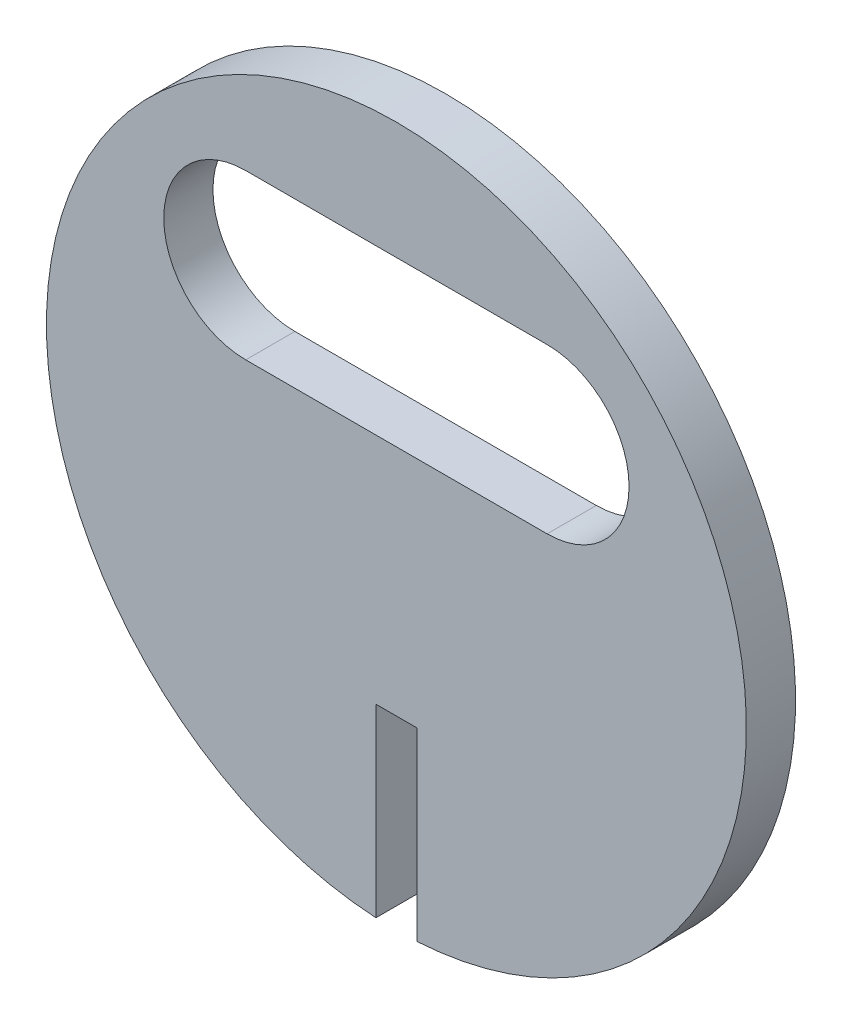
ISO-10303-21;
HEADER;
FILE_DESCRIPTION(('STEP AP214'),'2;1');
FILE_NAME('part.step','',(''),(''),'','','');
FILE_SCHEMA(('AUTOMOTIVE_DESIGN { 1 0 10303 214 1 1 1 1 }'));
ENDSEC;
DATA;
#1=APPLICATION_CONTEXT('core data for automotive mechanical design processes');
#2=APPLICATION_PROTOCOL_DEFINITION('international standard','automotive_design',2000,#1);
#3=PRODUCT_CONTEXT('',#1,'mechanical');
#4=PRODUCT('Part','Part','',(#3));
#5=PRODUCT_RELATED_PRODUCT_CATEGORY('part','',(#4));
#6=PRODUCT_DEFINITION_FORMATION('','',#4);
#7=PRODUCT_DEFINITION_CONTEXT('part definition',#1,'design');
#8=PRODUCT_DEFINITION('design','',#6,#7);
#9=PRODUCT_DEFINITION_SHAPE('','',#8);
#10=(LENGTH_UNIT() NAMED_UNIT(*) SI_UNIT(.MILLI.,.METRE.));
#11=(NAMED_UNIT(*) PLANE_ANGLE_UNIT() SI_UNIT($,.RADIAN.));
#12=(NAMED_UNIT(*) SI_UNIT($,.STERADIAN.) SOLID_ANGLE_UNIT());
#13=UNCERTAINTY_MEASURE_WITH_UNIT(LENGTH_MEASURE(1.E-05),#10,'distance_accuracy_value','');
#14=(GEOMETRIC_REPRESENTATION_CONTEXT(3) GLOBAL_UNCERTAINTY_ASSIGNED_CONTEXT((#13)) GLOBAL_UNIT_ASSIGNED_CONTEXT((#10,
#11,#12)) REPRESENTATION_CONTEXT('',''));
#15=CARTESIAN_POINT('',(0.,0.,0.));
#16=DIRECTION('',(0.,0.,1.));
#17=DIRECTION('',(1.,0.,0.));
#18=AXIS2_PLACEMENT_3D('',#15,#16,#17);
#19=CARTESIAN_POINT('',(0.,0.,3.81));
#20=DIRECTION('',(0.,0.,1.));
#21=DIRECTION('',(1.,0.,0.));
#22=AXIS2_PLACEMENT_3D('',#19,#20,#21);
#23=PLANE('',#22);
#24=CARTESIAN_POINT('',(11.6743329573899,11.6743329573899,3.81));
#25=DIRECTION('',(0.,0.,1.));
#26=DIRECTION('',(1.,0.,0.));
#27=AXIS2_PLACEMENT_3D('',#24,#25,#26);
#28=CIRCLE('',#27,6.35);
#29=CARTESIAN_POINT('',(11.6743329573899,5.32433295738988,3.81));
#30=VERTEX_POINT('',#29);
#31=CARTESIAN_POINT('',(11.6743329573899,18.0243329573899,3.81));
#32=VERTEX_POINT('',#31);
#33=EDGE_CURVE('E142',#30,#32,#28,.T.);
#34=ORIENTED_EDGE('',*,*,#33,.F.);
#35=DIRECTION('',(1.,0.,0.));
#36=VECTOR('',#35,1.);
#37=CARTESIAN_POINT('',(11.6743329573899,5.32433295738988,3.81));
#38=LINE('',#37,#36);
#39=CARTESIAN_POINT('',(-11.6743329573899,5.32433295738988,3.81));
#40=VERTEX_POINT('',#39);
#41=EDGE_CURVE('E140',#40,#30,#38,.T.);
#42=ORIENTED_EDGE('',*,*,#41,.F.);
#43=CARTESIAN_POINT('',(-11.6743329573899,11.6743329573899,3.81));
#44=DIRECTION('',(0.,0.,1.));
#45=DIRECTION('',(-1.,0.,0.));
#46=AXIS2_PLACEMENT_3D('',#43,#44,#45);
#47=CIRCLE('',#46,6.35);
#48=CARTESIAN_POINT('',(-11.6743329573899,18.0243329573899,3.81));
#49=VERTEX_POINT('',#48);
#50=EDGE_CURVE('E138',#49,#40,#47,.T.);
#51=ORIENTED_EDGE('',*,*,#50,.F.);
#52=DIRECTION('',(-1.,0.,0.));
#53=VECTOR('',#52,1.);
#54=CARTESIAN_POINT('',(-11.6743329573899,18.0243329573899,3.81));
#55=LINE('',#54,#53);
#56=EDGE_CURVE('E144',#32,#49,#55,.T.);
#57=ORIENTED_EDGE('',*,*,#56,.F.);
#58=EDGE_LOOP('',(#34,#42,#51,#57));
#59=FACE_BOUND('',#58,.T.);
#60=CARTESIAN_POINT('',(0.,0.,3.81));
#61=DIRECTION('',(0.,0.,1.));
#62=DIRECTION('',(1.,0.,0.));
#63=AXIS2_PLACEMENT_3D('',#60,#61,#62);
#64=CIRCLE('',#63,27.1145);
#65=CARTESIAN_POINT('',(1.5875,-27.0679876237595,3.81));
#66=VERTEX_POINT('',#65);
#67=CARTESIAN_POINT('',(-1.5875,-27.0679876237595,3.81));
#68=VERTEX_POINT('',#67);
#69=EDGE_CURVE('E155',#66,#68,#64,.T.);
#70=ORIENTED_EDGE('',*,*,#69,.T.);
#71=DIRECTION('',(0.,-1.,0.));
#72=VECTOR('',#71,1.);
#73=CARTESIAN_POINT('',(-1.5875,-12.7381,3.81));
#74=LINE('',#73,#72);
#75=CARTESIAN_POINT('',(-1.5875,-12.7381,3.81));
#76=VERTEX_POINT('',#75);
#77=EDGE_CURVE('E112',#76,#68,#74,.T.);
#78=ORIENTED_EDGE('',*,*,#77,.F.);
#79=DIRECTION('',(-1.,0.,0.));
#80=VECTOR('',#79,1.);
#81=CARTESIAN_POINT('',(-1.5875,-12.7381,3.81));
#82=LINE('',#81,#80);
#83=CARTESIAN_POINT('',(1.5875,-12.7381,3.81));
#84=VERTEX_POINT('',#83);
#85=EDGE_CURVE('E124',#84,#76,#82,.T.);
#86=ORIENTED_EDGE('',*,*,#85,.F.);
#87=DIRECTION('',(0.,1.,0.));
#88=VECTOR('',#87,1.);
#89=CARTESIAN_POINT('',(1.5875,-12.7381,3.81));
#90=LINE('',#89,#88);
#91=EDGE_CURVE('E99',#66,#84,#90,.T.);
#92=ORIENTED_EDGE('',*,*,#91,.F.);
#93=EDGE_LOOP('',(#70,#78,#86,#92));
#94=FACE_BOUND('',#93,.T.);
#95=ADVANCED_FACE('F33',(#59,#94),#23,.T.);
#96=CARTESIAN_POINT('',(0.,0.,0.));
#97=DIRECTION('',(0.,0.,1.));
#98=DIRECTION('',(1.,0.,0.));
#99=AXIS2_PLACEMENT_3D('',#96,#97,#98);
#100=PLANE('',#99);
#101=DIRECTION('',(1.,0.,0.));
#102=VECTOR('',#101,1.);
#103=CARTESIAN_POINT('',(11.6743329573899,5.32433295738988,0.));
#104=LINE('',#103,#102);
#105=CARTESIAN_POINT('',(-11.6743329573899,5.32433295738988,0.));
#106=VERTEX_POINT('',#105);
#107=CARTESIAN_POINT('',(11.6743329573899,5.32433295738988,0.));
#108=VERTEX_POINT('',#107);
#109=EDGE_CURVE('E102',#106,#108,#104,.T.);
#110=ORIENTED_EDGE('',*,*,#109,.T.);
#111=CARTESIAN_POINT('',(11.6743329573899,11.6743329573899,0.));
#112=DIRECTION('',(0.,0.,1.));
#113=DIRECTION('',(-1.,0.,0.));
#114=AXIS2_PLACEMENT_3D('',#111,#112,#113);
#115=CIRCLE('',#114,6.35);
#116=CARTESIAN_POINT('',(11.6743329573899,18.0243329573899,0.));
#117=VERTEX_POINT('',#116);
#118=EDGE_CURVE('E129',#108,#117,#115,.T.);
#119=ORIENTED_EDGE('',*,*,#118,.T.);
#120=DIRECTION('',(-1.,0.,0.));
#121=VECTOR('',#120,1.);
#122=CARTESIAN_POINT('',(-11.6743329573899,18.0243329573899,0.));
#123=LINE('',#122,#121);
#124=CARTESIAN_POINT('',(-11.6743329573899,18.0243329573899,0.));
#125=VERTEX_POINT('',#124);
#126=EDGE_CURVE('E132',#117,#125,#123,.T.);
#127=ORIENTED_EDGE('',*,*,#126,.T.);
#128=CARTESIAN_POINT('',(-11.6743329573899,11.6743329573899,0.));
#129=DIRECTION('',(0.,0.,1.));
#130=DIRECTION('',(1.,0.,0.));
#131=AXIS2_PLACEMENT_3D('',#128,#129,#130);
#132=CIRCLE('',#131,6.35);
#133=EDGE_CURVE('E135',#125,#106,#132,.T.);
#134=ORIENTED_EDGE('',*,*,#133,.T.);
#135=EDGE_LOOP('',(#110,#119,#127,#134));
#136=FACE_BOUND('',#135,.T.);
#137=DIRECTION('',(0.,-1.,0.));
#138=VECTOR('',#137,1.);
#139=CARTESIAN_POINT('',(-1.5875,-12.7381,0.));
#140=LINE('',#139,#138);
#141=CARTESIAN_POINT('',(-1.5875,-12.7381,0.));
#142=VERTEX_POINT('',#141);
#143=CARTESIAN_POINT('',(-1.5875,-27.0679876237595,0.));
#144=VERTEX_POINT('',#143);
#145=EDGE_CURVE('E118',#142,#144,#140,.T.);
#146=ORIENTED_EDGE('',*,*,#145,.T.);
#147=CARTESIAN_POINT('',(0.,0.,0.));
#148=DIRECTION('',(0.,0.,1.));
#149=DIRECTION('',(1.,0.,0.));
#150=AXIS2_PLACEMENT_3D('',#147,#148,#149);
#151=CIRCLE('',#150,27.1145);
#152=CARTESIAN_POINT('',(1.5875,-27.0679876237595,0.));
#153=VERTEX_POINT('',#152);
#154=EDGE_CURVE('E117',#153,#144,#151,.T.);
#155=ORIENTED_EDGE('',*,*,#154,.F.);
#156=DIRECTION('',(0.,1.,0.));
#157=VECTOR('',#156,1.);
#158=CARTESIAN_POINT('',(1.5875,-12.7381,0.));
#159=LINE('',#158,#157);
#160=CARTESIAN_POINT('',(1.5875,-12.7381,0.));
#161=VERTEX_POINT('',#160);
#162=EDGE_CURVE('E48',#153,#161,#159,.T.);
#163=ORIENTED_EDGE('',*,*,#162,.T.);
#164=DIRECTION('',(-1.,0.,0.));
#165=VECTOR('',#164,1.);
#166=CARTESIAN_POINT('',(-1.5875,-12.7381,0.));
#167=LINE('',#166,#165);
#168=EDGE_CURVE('E106',#161,#142,#167,.T.);
#169=ORIENTED_EDGE('',*,*,#168,.T.);
#170=EDGE_LOOP('',(#146,#155,#163,#169));
#171=FACE_BOUND('',#170,.T.);
#172=ADVANCED_FACE('F115',(#136,#171),#100,.F.);
#173=CARTESIAN_POINT('',(0.,0.,3.81));
#174=DIRECTION('',(0.,0.,-1.));
#175=DIRECTION('',(-1.,0.,0.));
#176=AXIS2_PLACEMENT_3D('',#173,#174,#175);
#177=CYLINDRICAL_SURFACE('',#176,27.1145);
#178=DIRECTION('',(0.,0.,-1.));
#179=VECTOR('',#178,1.);
#180=CARTESIAN_POINT('',(-1.5875,-27.0679876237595,3.81));
#181=LINE('',#180,#179);
#182=EDGE_CURVE('E11',#68,#144,#181,.T.);
#183=ORIENTED_EDGE('',*,*,#182,.F.);
#184=ORIENTED_EDGE('',*,*,#69,.F.);
#185=DIRECTION('',(0.,0.,-1.));
#186=VECTOR('',#185,1.);
#187=CARTESIAN_POINT('',(1.5875,-27.0679876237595,3.81));
#188=LINE('',#187,#186);
#189=EDGE_CURVE('E41',#153,#66,#188,.F.);
#190=ORIENTED_EDGE('',*,*,#189,.F.);
#191=ORIENTED_EDGE('',*,*,#154,.T.);
#192=EDGE_LOOP('',(#183,#184,#190,#191));
#193=FACE_BOUND('',#192,.T.);
#194=ADVANCED_FACE('F35',(#193),#177,.T.);
#195=CARTESIAN_POINT('',(11.6743329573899,5.32433295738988,3.81));
#196=DIRECTION('',(0.,1.,0.));
#197=DIRECTION('',(0.,0.,1.));
#198=AXIS2_PLACEMENT_3D('',#195,#196,#197);
#199=PLANE('',#198);
#200=ORIENTED_EDGE('',*,*,#109,.F.);
#201=DIRECTION('',(0.,0.,-1.));
#202=VECTOR('',#201,1.);
#203=CARTESIAN_POINT('',(-11.6743329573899,5.32433295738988,3.81));
#204=LINE('',#203,#202);
#205=EDGE_CURVE('E152',#40,#106,#204,.T.);
#206=ORIENTED_EDGE('',*,*,#205,.F.);
#207=ORIENTED_EDGE('',*,*,#41,.T.);
#208=DIRECTION('',(0.,0.,-1.));
#209=VECTOR('',#208,1.);
#210=CARTESIAN_POINT('',(11.6743329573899,5.32433295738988,3.81));
#211=LINE('',#210,#209);
#212=EDGE_CURVE('E149',#30,#108,#211,.T.);
#213=ORIENTED_EDGE('',*,*,#212,.T.);
#214=EDGE_LOOP('',(#200,#206,#207,#213));
#215=FACE_BOUND('',#214,.T.);
#216=ADVANCED_FACE('F183',(#215),#199,.T.);
#217=CARTESIAN_POINT('',(11.6743329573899,11.6743329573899,3.81));
#218=DIRECTION('',(0.,0.,-1.));
#219=DIRECTION('',(-1.,0.,0.));
#220=AXIS2_PLACEMENT_3D('',#217,#218,#219);
#221=CYLINDRICAL_SURFACE('',#220,6.35);
#222=ORIENTED_EDGE('',*,*,#118,.F.);
#223=ORIENTED_EDGE('',*,*,#212,.F.);
#224=ORIENTED_EDGE('',*,*,#33,.T.);
#225=DIRECTION('',(0.,0.,-1.));
#226=VECTOR('',#225,1.);
#227=CARTESIAN_POINT('',(11.6743329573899,18.0243329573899,3.81));
#228=LINE('',#227,#226);
#229=EDGE_CURVE('E147',#32,#117,#228,.T.);
#230=ORIENTED_EDGE('',*,*,#229,.T.);
#231=EDGE_LOOP('',(#222,#223,#224,#230));
#232=FACE_BOUND('',#231,.T.);
#233=ADVANCED_FACE('F186',(#232),#221,.F.);
#234=CARTESIAN_POINT('',(-11.6743329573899,18.0243329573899,3.81));
#235=DIRECTION('',(0.,-1.,0.));
#236=DIRECTION('',(0.,0.,-1.));
#237=AXIS2_PLACEMENT_3D('',#234,#235,#236);
#238=PLANE('',#237);
#239=ORIENTED_EDGE('',*,*,#126,.F.);
#240=ORIENTED_EDGE('',*,*,#229,.F.);
#241=ORIENTED_EDGE('',*,*,#56,.T.);
#242=DIRECTION('',(0.,0.,-1.));
#243=VECTOR('',#242,1.);
#244=CARTESIAN_POINT('',(-11.6743329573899,18.0243329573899,3.81));
#245=LINE('',#244,#243);
#246=EDGE_CURVE('E56',#49,#125,#245,.T.);
#247=ORIENTED_EDGE('',*,*,#246,.T.);
#248=EDGE_LOOP('',(#239,#240,#241,#247));
#249=FACE_BOUND('',#248,.T.);
#250=ADVANCED_FACE('F172',(#249),#238,.T.);
#251=CARTESIAN_POINT('',(-11.6743329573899,11.6743329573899,3.81));
#252=DIRECTION('',(0.,0.,-1.));
#253=DIRECTION('',(-1.,0.,0.));
#254=AXIS2_PLACEMENT_3D('',#251,#252,#253);
#255=CYLINDRICAL_SURFACE('',#254,6.35);
#256=ORIENTED_EDGE('',*,*,#133,.F.);
#257=ORIENTED_EDGE('',*,*,#246,.F.);
#258=ORIENTED_EDGE('',*,*,#50,.T.);
#259=ORIENTED_EDGE('',*,*,#205,.T.);
#260=EDGE_LOOP('',(#256,#257,#258,#259));
#261=FACE_BOUND('',#260,.T.);
#262=ADVANCED_FACE('F165',(#261),#255,.F.);
#263=CARTESIAN_POINT('',(-1.5875,-12.7381,3.81));
#264=DIRECTION('',(1.,0.,0.));
#265=DIRECTION('',(0.,1.,0.));
#266=AXIS2_PLACEMENT_3D('',#263,#264,#265);
#267=PLANE('',#266);
#268=ORIENTED_EDGE('',*,*,#182,.T.);
#269=ORIENTED_EDGE('',*,*,#145,.F.);
#270=DIRECTION('',(0.,0.,-1.));
#271=VECTOR('',#270,1.);
#272=CARTESIAN_POINT('',(-1.5875,-12.7381,3.81));
#273=LINE('',#272,#271);
#274=EDGE_CURVE('E103',#76,#142,#273,.T.);
#275=ORIENTED_EDGE('',*,*,#274,.F.);
#276=ORIENTED_EDGE('',*,*,#77,.T.);
#277=EDGE_LOOP('',(#268,#269,#275,#276));
#278=FACE_BOUND('',#277,.T.);
#279=ADVANCED_FACE('F163',(#278),#267,.T.);
#280=CARTESIAN_POINT('',(1.5875,-12.7381,3.81));
#281=DIRECTION('',(-1.,0.,0.));
#282=DIRECTION('',(0.,-1.,0.));
#283=AXIS2_PLACEMENT_3D('',#280,#281,#282);
#284=PLANE('',#283);
#285=ORIENTED_EDGE('',*,*,#189,.T.);
#286=ORIENTED_EDGE('',*,*,#91,.T.);
#287=DIRECTION('',(0.,0.,-1.));
#288=VECTOR('',#287,1.);
#289=CARTESIAN_POINT('',(1.5875,-12.7381,3.81));
#290=LINE('',#289,#288);
#291=EDGE_CURVE('E95',#84,#161,#290,.T.);
#292=ORIENTED_EDGE('',*,*,#291,.T.);
#293=ORIENTED_EDGE('',*,*,#162,.F.);
#294=EDGE_LOOP('',(#285,#286,#292,#293));
#295=FACE_BOUND('',#294,.T.);
#296=ADVANCED_FACE('F97',(#295),#284,.T.);
#297=CARTESIAN_POINT('',(-1.5875,-12.7381,3.81));
#298=DIRECTION('',(0.,-1.,0.));
#299=DIRECTION('',(0.,0.,-1.));
#300=AXIS2_PLACEMENT_3D('',#297,#298,#299);
#301=PLANE('',#300);
#302=ORIENTED_EDGE('',*,*,#168,.F.);
#303=ORIENTED_EDGE('',*,*,#291,.F.);
#304=ORIENTED_EDGE('',*,*,#85,.T.);
#305=ORIENTED_EDGE('',*,*,#274,.T.);
#306=EDGE_LOOP('',(#302,#303,#304,#305));
#307=FACE_BOUND('',#306,.T.);
#308=ADVANCED_FACE('F107',(#307),#301,.T.);
#309=CLOSED_SHELL('',(#95,#172,#194,#216,#233,#250,#262,#279,#296,#308));
#310=MANIFOLD_SOLID_BREP('B2',#309);
#311=ADVANCED_BREP_SHAPE_REPRESENTATION('',(#18,#310),#14);
#312=SHAPE_DEFINITION_REPRESENTATION(#9,#311);
ENDSEC;
END-ISO-10303-21;
